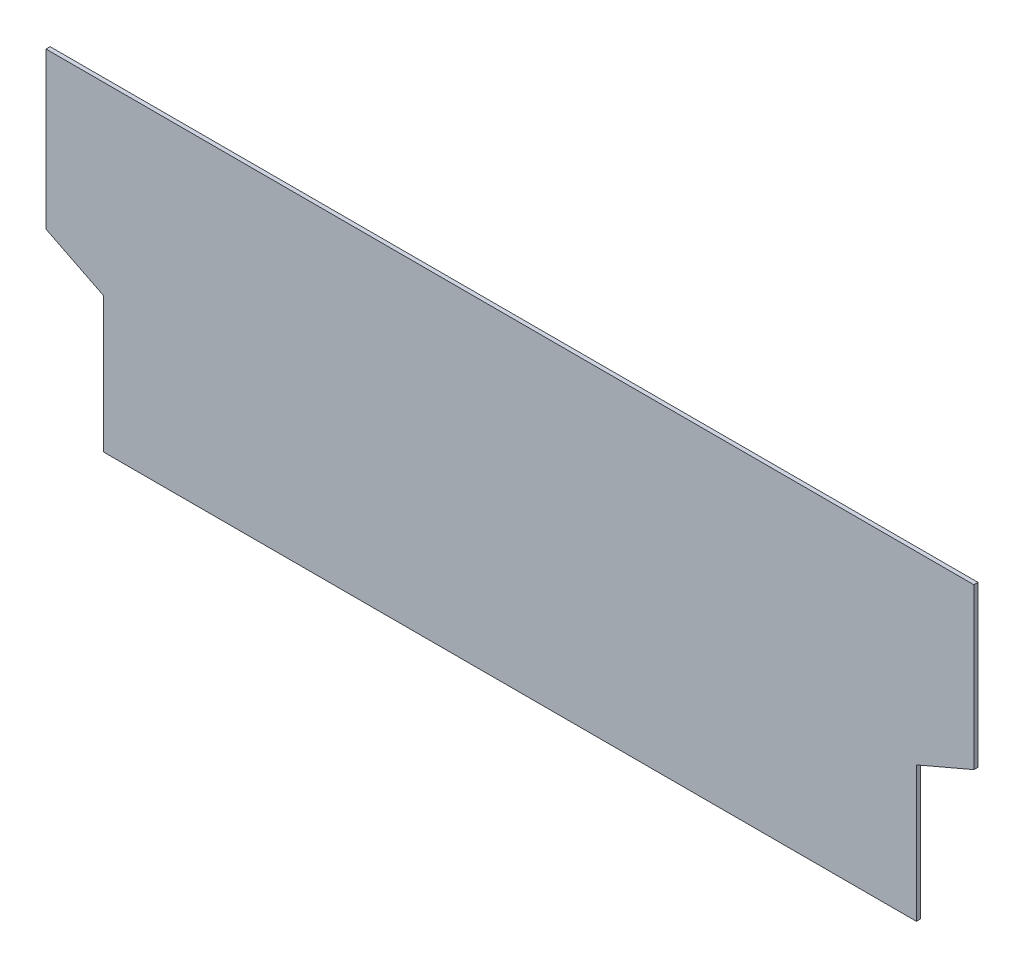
ISO-10303-21;
HEADER;
FILE_DESCRIPTION(('STEP AP214'),'2;1');
FILE_NAME('part.step','',(''),(''),'','','');
FILE_SCHEMA(('AUTOMOTIVE_DESIGN { 1 0 10303 214 1 1 1 1 }'));
ENDSEC;
DATA;
#1=APPLICATION_CONTEXT('core data for automotive mechanical design processes');
#2=APPLICATION_PROTOCOL_DEFINITION('international standard','automotive_design',2000,#1);
#3=PRODUCT_CONTEXT('',#1,'mechanical');
#4=PRODUCT('Part','Part','',(#3));
#5=PRODUCT_RELATED_PRODUCT_CATEGORY('part','',(#4));
#6=PRODUCT_DEFINITION_FORMATION('','',#4);
#7=PRODUCT_DEFINITION_CONTEXT('part definition',#1,'design');
#8=PRODUCT_DEFINITION('design','',#6,#7);
#9=PRODUCT_DEFINITION_SHAPE('','',#8);
#10=(LENGTH_UNIT() NAMED_UNIT(*) SI_UNIT(.MILLI.,.METRE.));
#11=(NAMED_UNIT(*) PLANE_ANGLE_UNIT() SI_UNIT($,.RADIAN.));
#12=(NAMED_UNIT(*) SI_UNIT($,.STERADIAN.) SOLID_ANGLE_UNIT());
#13=UNCERTAINTY_MEASURE_WITH_UNIT(LENGTH_MEASURE(1.E-05),#10,'distance_accuracy_value','');
#14=(GEOMETRIC_REPRESENTATION_CONTEXT(3) GLOBAL_UNCERTAINTY_ASSIGNED_CONTEXT((#13)) GLOBAL_UNIT_ASSIGNED_CONTEXT((#10,
#11,#12)) REPRESENTATION_CONTEXT('',''));
#15=CARTESIAN_POINT('',(0.,0.,0.));
#16=DIRECTION('',(0.,0.,1.));
#17=DIRECTION('',(1.,0.,0.));
#18=AXIS2_PLACEMENT_3D('',#15,#16,#17);
#19=CARTESIAN_POINT('',(-97.0727272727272,64.2545454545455,1.));
#20=DIRECTION('',(1.,0.,0.));
#21=DIRECTION('',(0.,0.,-1.));
#22=AXIS2_PLACEMENT_3D('',#19,#20,#21);
#23=PLANE('',#22);
#24=DIRECTION('',(0.,-1.,0.));
#25=VECTOR('',#24,1.);
#26=CARTESIAN_POINT('',(-97.0727272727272,64.2545454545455,0.));
#27=LINE('',#26,#25);
#28=CARTESIAN_POINT('',(-97.0727272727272,64.2545454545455,0.));
#29=VERTEX_POINT('',#28);
#30=CARTESIAN_POINT('',(-97.0727272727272,26.2545454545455,0.));
#31=VERTEX_POINT('',#30);
#32=EDGE_CURVE('E131',#29,#31,#27,.T.);
#33=ORIENTED_EDGE('',*,*,#32,.T.);
#34=DIRECTION('',(0.,0.,-1.));
#35=VECTOR('',#34,1.);
#36=CARTESIAN_POINT('',(-97.0727272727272,26.2545454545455,1.));
#37=LINE('',#36,#35);
#38=CARTESIAN_POINT('',(-97.0727272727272,26.2545454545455,1.));
#39=VERTEX_POINT('',#38);
#40=EDGE_CURVE('E11',#39,#31,#37,.T.);
#41=ORIENTED_EDGE('',*,*,#40,.F.);
#42=DIRECTION('',(0.,-1.,0.));
#43=VECTOR('',#42,1.);
#44=CARTESIAN_POINT('',(-97.0727272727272,64.2545454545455,1.));
#45=LINE('',#44,#43);
#46=CARTESIAN_POINT('',(-97.0727272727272,64.2545454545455,1.));
#47=VERTEX_POINT('',#46);
#48=EDGE_CURVE('E149',#47,#39,#45,.T.);
#49=ORIENTED_EDGE('',*,*,#48,.F.);
#50=DIRECTION('',(0.,0.,-1.));
#51=VECTOR('',#50,1.);
#52=CARTESIAN_POINT('',(-97.0727272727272,64.2545454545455,1.));
#53=LINE('',#52,#51);
#54=EDGE_CURVE('E51',#47,#29,#53,.T.);
#55=ORIENTED_EDGE('',*,*,#54,.T.);
#56=EDGE_LOOP('',(#33,#41,#49,#55));
#57=FACE_BOUND('',#56,.T.);
#58=ADVANCED_FACE('F35',(#57),#23,.F.);
#59=CARTESIAN_POINT('',(-97.0727272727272,26.2545454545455,1.));
#60=DIRECTION('',(0.447213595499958,0.894427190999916,0.));
#61=DIRECTION('',(-0.894427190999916,0.447213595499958,0.));
#62=AXIS2_PLACEMENT_3D('',#59,#60,#61);
#63=PLANE('',#62);
#64=DIRECTION('',(0.894427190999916,-0.447213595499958,0.));
#65=VECTOR('',#64,1.);
#66=CARTESIAN_POINT('',(-97.0727272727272,26.2545454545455,0.));
#67=LINE('',#66,#65);
#68=CARTESIAN_POINT('',(-83.0727272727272,19.2545454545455,0.));
#69=VERTEX_POINT('',#68);
#70=EDGE_CURVE('E133',#31,#69,#67,.T.);
#71=ORIENTED_EDGE('',*,*,#70,.T.);
#72=DIRECTION('',(0.,0.,-1.));
#73=VECTOR('',#72,1.);
#74=CARTESIAN_POINT('',(-83.0727272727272,19.2545454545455,1.));
#75=LINE('',#74,#73);
#76=CARTESIAN_POINT('',(-83.0727272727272,19.2545454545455,1.));
#77=VERTEX_POINT('',#76);
#78=EDGE_CURVE('E43',#77,#69,#75,.T.);
#79=ORIENTED_EDGE('',*,*,#78,.F.);
#80=DIRECTION('',(0.894427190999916,-0.447213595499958,0.));
#81=VECTOR('',#80,1.);
#82=CARTESIAN_POINT('',(-97.0727272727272,26.2545454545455,1.));
#83=LINE('',#82,#81);
#84=EDGE_CURVE('E90',#39,#77,#83,.T.);
#85=ORIENTED_EDGE('',*,*,#84,.F.);
#86=ORIENTED_EDGE('',*,*,#40,.T.);
#87=EDGE_LOOP('',(#71,#79,#85,#86));
#88=FACE_BOUND('',#87,.T.);
#89=ADVANCED_FACE('F178',(#88),#63,.F.);
#90=CARTESIAN_POINT('',(-83.0727272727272,19.2545454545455,1.));
#91=DIRECTION('',(1.,0.,0.));
#92=DIRECTION('',(0.,0.,-1.));
#93=AXIS2_PLACEMENT_3D('',#90,#91,#92);
#94=PLANE('',#93);
#95=DIRECTION('',(0.,-1.,0.));
#96=VECTOR('',#95,1.);
#97=CARTESIAN_POINT('',(-83.0727272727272,19.2545454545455,0.));
#98=LINE('',#97,#96);
#99=CARTESIAN_POINT('',(-83.0727272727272,-13.7454545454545,0.));
#100=VERTEX_POINT('',#99);
#101=EDGE_CURVE('E135',#69,#100,#98,.T.);
#102=ORIENTED_EDGE('',*,*,#101,.T.);
#103=DIRECTION('',(0.,0.,-1.));
#104=VECTOR('',#103,1.);
#105=CARTESIAN_POINT('',(-83.0727272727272,-13.7454545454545,1.));
#106=LINE('',#105,#104);
#107=CARTESIAN_POINT('',(-83.0727272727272,-13.7454545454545,1.));
#108=VERTEX_POINT('',#107);
#109=EDGE_CURVE('E155',#108,#100,#106,.T.);
#110=ORIENTED_EDGE('',*,*,#109,.F.);
#111=DIRECTION('',(0.,-1.,0.));
#112=VECTOR('',#111,1.);
#113=CARTESIAN_POINT('',(-83.0727272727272,19.2545454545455,1.));
#114=LINE('',#113,#112);
#115=EDGE_CURVE('E163',#77,#108,#114,.T.);
#116=ORIENTED_EDGE('',*,*,#115,.F.);
#117=ORIENTED_EDGE('',*,*,#78,.T.);
#118=EDGE_LOOP('',(#102,#110,#116,#117));
#119=FACE_BOUND('',#118,.T.);
#120=ADVANCED_FACE('F161',(#119),#94,.F.);
#121=CARTESIAN_POINT('',(-83.0727272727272,-13.7454545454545,1.));
#122=DIRECTION('',(0.,1.,0.));
#123=DIRECTION('',(0.,0.,1.));
#124=AXIS2_PLACEMENT_3D('',#121,#122,#123);
#125=PLANE('',#124);
#126=DIRECTION('',(1.,0.,0.));
#127=VECTOR('',#126,1.);
#128=CARTESIAN_POINT('',(-83.0727272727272,-13.7454545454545,0.));
#129=LINE('',#128,#127);
#130=CARTESIAN_POINT('',(114.927272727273,-13.7454545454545,0.));
#131=VERTEX_POINT('',#130);
#132=EDGE_CURVE('E137',#100,#131,#129,.T.);
#133=ORIENTED_EDGE('',*,*,#132,.T.);
#134=DIRECTION('',(0.,0.,-1.));
#135=VECTOR('',#134,1.);
#136=CARTESIAN_POINT('',(114.927272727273,-13.7454545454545,1.));
#137=LINE('',#136,#135);
#138=CARTESIAN_POINT('',(114.927272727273,-13.7454545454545,1.));
#139=VERTEX_POINT('',#138);
#140=EDGE_CURVE('E153',#139,#131,#137,.T.);
#141=ORIENTED_EDGE('',*,*,#140,.F.);
#142=DIRECTION('',(1.,0.,0.));
#143=VECTOR('',#142,1.);
#144=CARTESIAN_POINT('',(-83.0727272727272,-13.7454545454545,1.));
#145=LINE('',#144,#143);
#146=EDGE_CURVE('E172',#108,#139,#145,.T.);
#147=ORIENTED_EDGE('',*,*,#146,.F.);
#148=ORIENTED_EDGE('',*,*,#109,.T.);
#149=EDGE_LOOP('',(#133,#141,#147,#148));
#150=FACE_BOUND('',#149,.T.);
#151=ADVANCED_FACE('F170',(#150),#125,.F.);
#152=CARTESIAN_POINT('',(114.927272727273,19.2545454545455,1.));
#153=DIRECTION('',(1.,0.,0.));
#154=DIRECTION('',(0.,0.,-1.));
#155=AXIS2_PLACEMENT_3D('',#152,#153,#154);
#156=PLANE('',#155);
#157=DIRECTION('',(0.,-1.,0.));
#158=VECTOR('',#157,1.);
#159=CARTESIAN_POINT('',(114.927272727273,19.2545454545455,0.));
#160=LINE('',#159,#158);
#161=CARTESIAN_POINT('',(114.927272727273,19.2545454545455,0.));
#162=VERTEX_POINT('',#161);
#163=EDGE_CURVE('E140',#162,#131,#160,.T.);
#164=ORIENTED_EDGE('',*,*,#163,.F.);
#165=DIRECTION('',(0.,0.,-1.));
#166=VECTOR('',#165,1.);
#167=CARTESIAN_POINT('',(114.927272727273,19.2545454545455,1.));
#168=LINE('',#167,#166);
#169=CARTESIAN_POINT('',(114.927272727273,19.2545454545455,1.));
#170=VERTEX_POINT('',#169);
#171=EDGE_CURVE('E123',#170,#162,#168,.T.);
#172=ORIENTED_EDGE('',*,*,#171,.F.);
#173=DIRECTION('',(0.,-1.,0.));
#174=VECTOR('',#173,1.);
#175=CARTESIAN_POINT('',(114.927272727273,19.2545454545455,1.));
#176=LINE('',#175,#174);
#177=EDGE_CURVE('E113',#170,#139,#176,.T.);
#178=ORIENTED_EDGE('',*,*,#177,.T.);
#179=ORIENTED_EDGE('',*,*,#140,.T.);
#180=EDGE_LOOP('',(#164,#172,#178,#179));
#181=FACE_BOUND('',#180,.T.);
#182=ADVANCED_FACE('F188',(#181),#156,.T.);
#183=CARTESIAN_POINT('',(114.927272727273,19.2545454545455,1.));
#184=DIRECTION('',(-0.393919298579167,0.919145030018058,0.));
#185=DIRECTION('',(-0.919145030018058,-0.393919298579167,0.));
#186=AXIS2_PLACEMENT_3D('',#183,#184,#185);
#187=PLANE('',#186);
#188=DIRECTION('',(0.919145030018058,0.393919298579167,0.));
#189=VECTOR('',#188,1.);
#190=CARTESIAN_POINT('',(114.927272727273,19.2545454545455,0.));
#191=LINE('',#190,#189);
#192=CARTESIAN_POINT('',(128.927272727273,25.2545454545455,0.));
#193=VERTEX_POINT('',#192);
#194=EDGE_CURVE('E120',#162,#193,#191,.T.);
#195=ORIENTED_EDGE('',*,*,#194,.T.);
#196=DIRECTION('',(0.,0.,-1.));
#197=VECTOR('',#196,1.);
#198=CARTESIAN_POINT('',(128.927272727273,25.2545454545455,1.));
#199=LINE('',#198,#197);
#200=CARTESIAN_POINT('',(128.927272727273,25.2545454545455,1.));
#201=VERTEX_POINT('',#200);
#202=EDGE_CURVE('E117',#201,#193,#199,.T.);
#203=ORIENTED_EDGE('',*,*,#202,.F.);
#204=DIRECTION('',(0.919145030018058,0.393919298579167,0.));
#205=VECTOR('',#204,1.);
#206=CARTESIAN_POINT('',(114.927272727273,19.2545454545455,1.));
#207=LINE('',#206,#205);
#208=EDGE_CURVE('E106',#170,#201,#207,.T.);
#209=ORIENTED_EDGE('',*,*,#208,.F.);
#210=ORIENTED_EDGE('',*,*,#171,.T.);
#211=EDGE_LOOP('',(#195,#203,#209,#210));
#212=FACE_BOUND('',#211,.T.);
#213=ADVANCED_FACE('F118',(#212),#187,.F.);
#214=CARTESIAN_POINT('',(128.927272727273,25.2545454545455,1.));
#215=DIRECTION('',(-1.,0.,0.));
#216=DIRECTION('',(0.,0.,1.));
#217=AXIS2_PLACEMENT_3D('',#214,#215,#216);
#218=PLANE('',#217);
#219=DIRECTION('',(0.,1.,0.));
#220=VECTOR('',#219,1.);
#221=CARTESIAN_POINT('',(128.927272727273,25.2545454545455,0.));
#222=LINE('',#221,#220);
#223=CARTESIAN_POINT('',(128.927272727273,64.2545454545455,0.));
#224=VERTEX_POINT('',#223);
#225=EDGE_CURVE('E144',#193,#224,#222,.T.);
#226=ORIENTED_EDGE('',*,*,#225,.T.);
#227=DIRECTION('',(0.,0.,-1.));
#228=VECTOR('',#227,1.);
#229=CARTESIAN_POINT('',(128.927272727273,64.2545454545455,1.));
#230=LINE('',#229,#228);
#231=CARTESIAN_POINT('',(128.927272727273,64.2545454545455,1.));
#232=VERTEX_POINT('',#231);
#233=EDGE_CURVE('E78',#232,#224,#230,.T.);
#234=ORIENTED_EDGE('',*,*,#233,.F.);
#235=DIRECTION('',(0.,1.,0.));
#236=VECTOR('',#235,1.);
#237=CARTESIAN_POINT('',(128.927272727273,25.2545454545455,1.));
#238=LINE('',#237,#236);
#239=EDGE_CURVE('E111',#201,#232,#238,.T.);
#240=ORIENTED_EDGE('',*,*,#239,.F.);
#241=ORIENTED_EDGE('',*,*,#202,.T.);
#242=EDGE_LOOP('',(#226,#234,#240,#241));
#243=FACE_BOUND('',#242,.T.);
#244=ADVANCED_FACE('F125',(#243),#218,.F.);
#245=CARTESIAN_POINT('',(-97.0727272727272,64.2545454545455,1.));
#246=DIRECTION('',(0.,1.,0.));
#247=DIRECTION('',(0.,0.,1.));
#248=AXIS2_PLACEMENT_3D('',#245,#246,#247);
#249=PLANE('',#248);
#250=DIRECTION('',(1.,0.,0.));
#251=VECTOR('',#250,1.);
#252=CARTESIAN_POINT('',(-97.0727272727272,64.2545454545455,0.));
#253=LINE('',#252,#251);
#254=EDGE_CURVE('E146',#29,#224,#253,.T.);
#255=ORIENTED_EDGE('',*,*,#254,.F.);
#256=ORIENTED_EDGE('',*,*,#54,.F.);
#257=DIRECTION('',(1.,0.,0.));
#258=VECTOR('',#257,1.);
#259=CARTESIAN_POINT('',(-97.0727272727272,64.2545454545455,1.));
#260=LINE('',#259,#258);
#261=EDGE_CURVE('E126',#47,#232,#260,.T.);
#262=ORIENTED_EDGE('',*,*,#261,.T.);
#263=ORIENTED_EDGE('',*,*,#233,.T.);
#264=EDGE_LOOP('',(#255,#256,#262,#263));
#265=FACE_BOUND('',#264,.T.);
#266=ADVANCED_FACE('F196',(#265),#249,.T.);
#267=CARTESIAN_POINT('',(0.,0.,1.));
#268=DIRECTION('',(0.,0.,1.));
#269=DIRECTION('',(1.,0.,0.));
#270=AXIS2_PLACEMENT_3D('',#267,#268,#269);
#271=PLANE('',#270);
#272=ORIENTED_EDGE('',*,*,#48,.T.);
#273=ORIENTED_EDGE('',*,*,#84,.T.);
#274=ORIENTED_EDGE('',*,*,#115,.T.);
#275=ORIENTED_EDGE('',*,*,#146,.T.);
#276=ORIENTED_EDGE('',*,*,#177,.F.);
#277=ORIENTED_EDGE('',*,*,#208,.T.);
#278=ORIENTED_EDGE('',*,*,#239,.T.);
#279=ORIENTED_EDGE('',*,*,#261,.F.);
#280=EDGE_LOOP('',(#272,#273,#274,#275,#276,#277,#278,#279));
#281=FACE_BOUND('',#280,.T.);
#282=ADVANCED_FACE('F108',(#281),#271,.T.);
#283=CARTESIAN_POINT('',(0.,0.,0.));
#284=DIRECTION('',(0.,0.,1.));
#285=DIRECTION('',(1.,0.,0.));
#286=AXIS2_PLACEMENT_3D('',#283,#284,#285);
#287=PLANE('',#286);
#288=ORIENTED_EDGE('',*,*,#32,.F.);
#289=ORIENTED_EDGE('',*,*,#254,.T.);
#290=ORIENTED_EDGE('',*,*,#225,.F.);
#291=ORIENTED_EDGE('',*,*,#194,.F.);
#292=ORIENTED_EDGE('',*,*,#163,.T.);
#293=ORIENTED_EDGE('',*,*,#132,.F.);
#294=ORIENTED_EDGE('',*,*,#101,.F.);
#295=ORIENTED_EDGE('',*,*,#70,.F.);
#296=EDGE_LOOP('',(#288,#289,#290,#291,#292,#293,#294,#295));
#297=FACE_BOUND('',#296,.T.);
#298=ADVANCED_FACE('F166',(#297),#287,.F.);
#299=CLOSED_SHELL('',(#58,#89,#120,#151,#182,#213,#244,#266,#282,#298));
#300=MANIFOLD_SOLID_BREP('B2',#299);
#301=ADVANCED_BREP_SHAPE_REPRESENTATION('',(#18,#300),#14);
#302=SHAPE_DEFINITION_REPRESENTATION(#9,#301);
ENDSEC;
END-ISO-10303-21;
